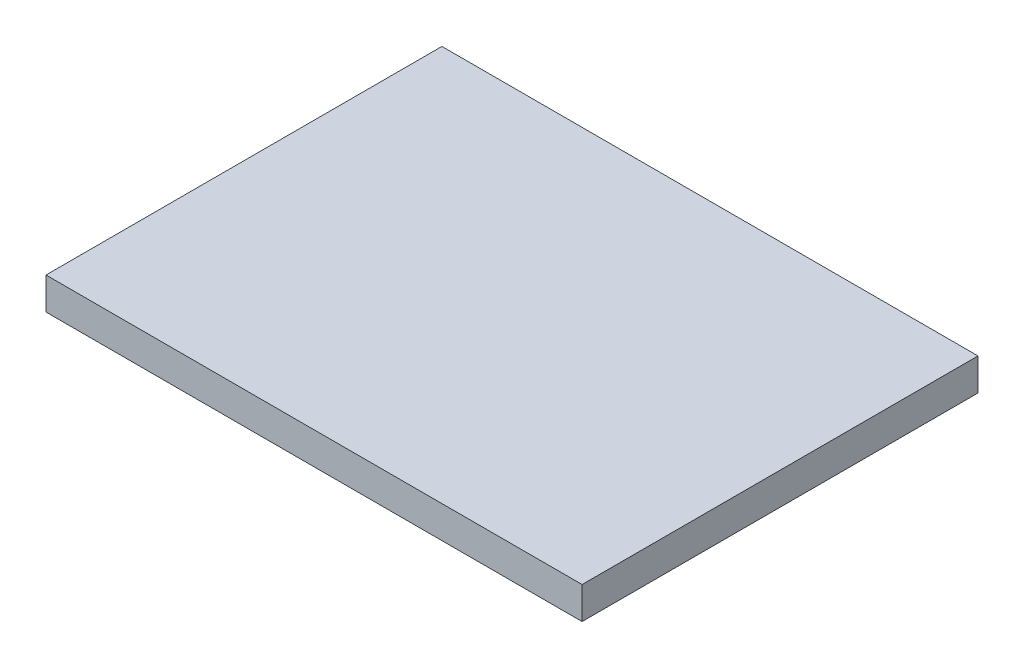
from build123d import *

# Parameters (mm, degrees)
SKIZZE2_W                       = 250.5
SKIZZE2_H                       = 185
AUFSATZ_LINEAR_AUSTRAGEN1_DEPTH = 15


with BuildPart() as part:
    # Skizze2 → Aufsatz-Linear austragen1 (new body)
    with BuildSketch(Plane(origin=(0, 0, 0), x_dir=(1, 0, 0), z_dir=(0, 1, 0))):
        Rectangle(SKIZZE2_W, SKIZZE2_H)
    extrude(amount=AUFSATZ_LINEAR_AUSTRAGEN1_DEPTH)


solid = part.part
